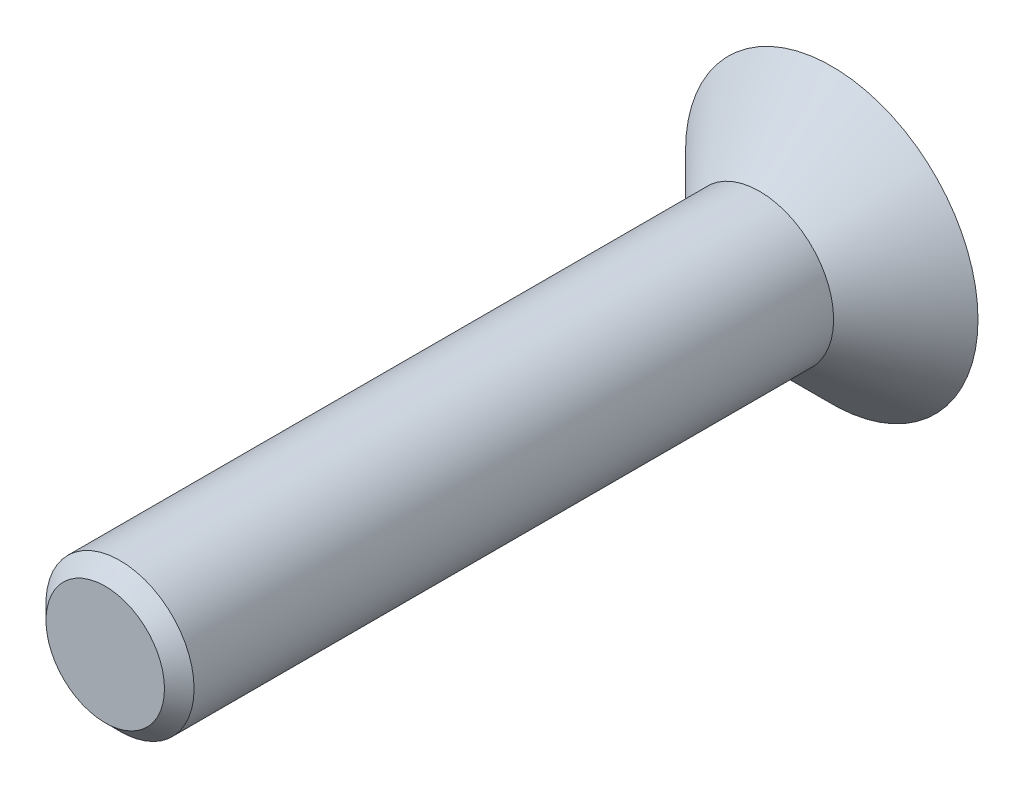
ISO-10303-21;
HEADER;
FILE_DESCRIPTION(('STEP AP214'),'2;1');
FILE_NAME('part.step','',(''),(''),'','','');
FILE_SCHEMA(('AUTOMOTIVE_DESIGN { 1 0 10303 214 1 1 1 1 }'));
ENDSEC;
DATA;
#1=APPLICATION_CONTEXT('core data for automotive mechanical design processes');
#2=APPLICATION_PROTOCOL_DEFINITION('international standard','automotive_design',2000,#1);
#3=PRODUCT_CONTEXT('',#1,'mechanical');
#4=PRODUCT('Part','Part','',(#3));
#5=PRODUCT_RELATED_PRODUCT_CATEGORY('part','',(#4));
#6=PRODUCT_DEFINITION_FORMATION('','',#4);
#7=PRODUCT_DEFINITION_CONTEXT('part definition',#1,'design');
#8=PRODUCT_DEFINITION('design','',#6,#7);
#9=PRODUCT_DEFINITION_SHAPE('','',#8);
#10=(LENGTH_UNIT() NAMED_UNIT(*) SI_UNIT(.MILLI.,.METRE.));
#11=(NAMED_UNIT(*) PLANE_ANGLE_UNIT() SI_UNIT($,.RADIAN.));
#12=(NAMED_UNIT(*) SI_UNIT($,.STERADIAN.) SOLID_ANGLE_UNIT());
#13=UNCERTAINTY_MEASURE_WITH_UNIT(LENGTH_MEASURE(1.E-05),#10,'distance_accuracy_value','');
#14=(GEOMETRIC_REPRESENTATION_CONTEXT(3) GLOBAL_UNCERTAINTY_ASSIGNED_CONTEXT((#13)) GLOBAL_UNIT_ASSIGNED_CONTEXT((#10,
#11,#12)) REPRESENTATION_CONTEXT('',''));
#15=CARTESIAN_POINT('',(0.,0.,0.));
#16=DIRECTION('',(0.,0.,1.));
#17=DIRECTION('',(1.,0.,0.));
#18=AXIS2_PLACEMENT_3D('',#15,#16,#17);
#19=CARTESIAN_POINT('',(0.,0.,-3.89999999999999));
#20=DIRECTION('',(0.,0.,1.));
#21=DIRECTION('',(1.,0.,0.));
#22=AXIS2_PLACEMENT_3D('',#19,#20,#21);
#23=PLANE('',#22);
#24=CARTESIAN_POINT('',(0.,0.,-3.89999999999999));
#25=DIRECTION('',(0.,0.,-1.));
#26=DIRECTION('',(-1.,0.,0.));
#27=AXIS2_PLACEMENT_3D('',#24,#25,#26);
#28=CIRCLE('',#27,7.9);
#29=CARTESIAN_POINT('',(-7.9,0.,-3.89999999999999));
#30=VERTEX_POINT('',#29);
#31=EDGE_CURVE('E138',#30,#30,#28,.T.);
#32=ORIENTED_EDGE('',*,*,#31,.T.);
#33=EDGE_LOOP('',(#32));
#34=FACE_BOUND('',#33,.T.);
#35=DIRECTION('',(-0.86602540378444,0.499999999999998,0.));
#36=VECTOR('',#35,1.);
#37=CARTESIAN_POINT('',(0.,2.88675134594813,-3.89999999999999));
#38=LINE('',#37,#36);
#39=CARTESIAN_POINT('',(2.5,1.44337567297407,-3.89999999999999));
#40=VERTEX_POINT('',#39);
#41=CARTESIAN_POINT('',(0.,2.88675134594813,-3.89999999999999));
#42=VERTEX_POINT('',#41);
#43=EDGE_CURVE('E46',#40,#42,#38,.T.);
#44=ORIENTED_EDGE('',*,*,#43,.T.);
#45=DIRECTION('',(-0.866025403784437,-0.500000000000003,0.));
#46=VECTOR('',#45,1.);
#47=CARTESIAN_POINT('',(-2.5,1.44337567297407,-3.89999999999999));
#48=LINE('',#47,#46);
#49=CARTESIAN_POINT('',(-2.5,1.44337567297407,-3.89999999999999));
#50=VERTEX_POINT('',#49);
#51=EDGE_CURVE('E117',#42,#50,#48,.T.);
#52=ORIENTED_EDGE('',*,*,#51,.T.);
#53=DIRECTION('',(0.,-1.,0.));
#54=VECTOR('',#53,1.);
#55=CARTESIAN_POINT('',(-2.5,-1.44337567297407,-3.89999999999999));
#56=LINE('',#55,#54);
#57=CARTESIAN_POINT('',(-2.5,-1.44337567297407,-3.89999999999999));
#58=VERTEX_POINT('',#57);
#59=EDGE_CURVE('E121',#50,#58,#56,.T.);
#60=ORIENTED_EDGE('',*,*,#59,.T.);
#61=DIRECTION('',(0.866025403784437,-0.500000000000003,0.));
#62=VECTOR('',#61,1.);
#63=CARTESIAN_POINT('',(-2.5,-1.44337567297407,-3.89999999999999));
#64=LINE('',#63,#62);
#65=CARTESIAN_POINT('',(0.,-2.88675134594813,-3.89999999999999));
#66=VERTEX_POINT('',#65);
#67=EDGE_CURVE('E124',#58,#66,#64,.T.);
#68=ORIENTED_EDGE('',*,*,#67,.T.);
#69=DIRECTION('',(0.86602540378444,0.499999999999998,0.));
#70=VECTOR('',#69,1.);
#71=CARTESIAN_POINT('',(0.,-2.88675134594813,-3.89999999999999));
#72=LINE('',#71,#70);
#73=CARTESIAN_POINT('',(2.5,-1.44337567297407,-3.89999999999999));
#74=VERTEX_POINT('',#73);
#75=EDGE_CURVE('E107',#66,#74,#72,.T.);
#76=ORIENTED_EDGE('',*,*,#75,.T.);
#77=DIRECTION('',(0.,1.,0.));
#78=VECTOR('',#77,1.);
#79=CARTESIAN_POINT('',(2.5,-1.44337567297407,-3.89999999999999));
#80=LINE('',#79,#78);
#81=EDGE_CURVE('E127',#74,#40,#80,.T.);
#82=ORIENTED_EDGE('',*,*,#81,.T.);
#83=EDGE_LOOP('',(#44,#52,#60,#68,#76,#82));
#84=FACE_BOUND('',#83,.T.);
#85=ADVANCED_FACE('F31',(#34,#84),#23,.F.);
#86=CARTESIAN_POINT('',(0.,0.,0.));
#87=DIRECTION('',(0.,0.,-1.));
#88=DIRECTION('',(-1.,0.,0.));
#89=AXIS2_PLACEMENT_3D('',#86,#87,#88);
#90=CONICAL_SURFACE('',#89,4.,0.78539816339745);
#91=ORIENTED_EDGE('',*,*,#31,.F.);
#92=EDGE_LOOP('',(#91));
#93=FACE_BOUND('',#92,.T.);
#94=CARTESIAN_POINT('',(0.,0.,0.));
#95=DIRECTION('',(0.,0.,1.));
#96=DIRECTION('',(1.,0.,0.));
#97=AXIS2_PLACEMENT_3D('',#94,#95,#96);
#98=CIRCLE('',#97,4.);
#99=CARTESIAN_POINT('',(4.,0.,0.));
#100=VERTEX_POINT('',#99);
#101=EDGE_CURVE('E118',#100,#100,#98,.T.);
#102=ORIENTED_EDGE('',*,*,#101,.F.);
#103=EDGE_LOOP('',(#102));
#104=FACE_BOUND('',#103,.T.);
#105=ADVANCED_FACE('F155',(#93,#104),#90,.T.);
#106=CARTESIAN_POINT('',(0.,2.88675134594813,-0.0999999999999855));
#107=DIRECTION('',(-0.499999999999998,-0.86602540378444,0.));
#108=DIRECTION('',(0.86602540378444,-0.499999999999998,0.));
#109=AXIS2_PLACEMENT_3D('',#106,#107,#108);
#110=PLANE('',#109);
#111=ORIENTED_EDGE('',*,*,#43,.F.);
#112=DIRECTION('',(0.,0.,-1.));
#113=VECTOR('',#112,1.);
#114=CARTESIAN_POINT('',(2.5,1.44337567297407,-0.0999999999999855));
#115=LINE('',#114,#113);
#116=CARTESIAN_POINT('',(2.5,1.44337567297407,-0.0999999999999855));
#117=VERTEX_POINT('',#116);
#118=EDGE_CURVE('E112',#117,#40,#115,.T.);
#119=ORIENTED_EDGE('',*,*,#118,.F.);
#120=DIRECTION('',(-0.86602540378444,0.499999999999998,0.));
#121=VECTOR('',#120,1.);
#122=CARTESIAN_POINT('',(0.,2.88675134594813,-0.0999999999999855));
#123=LINE('',#122,#121);
#124=CARTESIAN_POINT('',(0.,2.88675134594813,-0.0999999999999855));
#125=VERTEX_POINT('',#124);
#126=EDGE_CURVE('E130',#117,#125,#123,.T.);
#127=ORIENTED_EDGE('',*,*,#126,.T.);
#128=DIRECTION('',(0.,0.,-1.));
#129=VECTOR('',#128,1.);
#130=CARTESIAN_POINT('',(0.,2.88675134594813,-0.0999999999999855));
#131=LINE('',#130,#129);
#132=EDGE_CURVE('E136',#125,#42,#131,.T.);
#133=ORIENTED_EDGE('',*,*,#132,.T.);
#134=EDGE_LOOP('',(#111,#119,#127,#133));
#135=FACE_BOUND('',#134,.T.);
#136=ADVANCED_FACE('F160',(#135),#110,.T.);
#137=CARTESIAN_POINT('',(-2.5,1.44337567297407,-0.0999999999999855));
#138=DIRECTION('',(0.500000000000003,-0.866025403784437,0.));
#139=DIRECTION('',(0.866025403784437,0.500000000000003,0.));
#140=AXIS2_PLACEMENT_3D('',#137,#138,#139);
#141=PLANE('',#140);
#142=ORIENTED_EDGE('',*,*,#51,.F.);
#143=ORIENTED_EDGE('',*,*,#132,.F.);
#144=DIRECTION('',(-0.866025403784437,-0.500000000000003,0.));
#145=VECTOR('',#144,1.);
#146=CARTESIAN_POINT('',(-2.5,1.44337567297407,-0.0999999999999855));
#147=LINE('',#146,#145);
#148=CARTESIAN_POINT('',(-2.5,1.44337567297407,-0.0999999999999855));
#149=VERTEX_POINT('',#148);
#150=EDGE_CURVE('E85',#125,#149,#147,.T.);
#151=ORIENTED_EDGE('',*,*,#150,.T.);
#152=DIRECTION('',(0.,0.,-1.));
#153=VECTOR('',#152,1.);
#154=CARTESIAN_POINT('',(-2.5,1.44337567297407,-0.0999999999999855));
#155=LINE('',#154,#153);
#156=EDGE_CURVE('E134',#149,#50,#155,.T.);
#157=ORIENTED_EDGE('',*,*,#156,.T.);
#158=EDGE_LOOP('',(#142,#143,#151,#157));
#159=FACE_BOUND('',#158,.T.);
#160=ADVANCED_FACE('F167',(#159),#141,.T.);
#161=CARTESIAN_POINT('',(-2.5,-1.44337567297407,-0.0999999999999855));
#162=DIRECTION('',(1.,0.,0.));
#163=DIRECTION('',(0.,0.,-1.));
#164=AXIS2_PLACEMENT_3D('',#161,#162,#163);
#165=PLANE('',#164);
#166=ORIENTED_EDGE('',*,*,#59,.F.);
#167=ORIENTED_EDGE('',*,*,#156,.F.);
#168=DIRECTION('',(0.,-1.,0.));
#169=VECTOR('',#168,1.);
#170=CARTESIAN_POINT('',(-2.5,-1.44337567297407,-0.0999999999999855));
#171=LINE('',#170,#169);
#172=CARTESIAN_POINT('',(-2.5,-1.44337567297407,-0.0999999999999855));
#173=VERTEX_POINT('',#172);
#174=EDGE_CURVE('E103',#149,#173,#171,.T.);
#175=ORIENTED_EDGE('',*,*,#174,.T.);
#176=DIRECTION('',(0.,0.,-1.));
#177=VECTOR('',#176,1.);
#178=CARTESIAN_POINT('',(-2.5,-1.44337567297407,-0.0999999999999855));
#179=LINE('',#178,#177);
#180=EDGE_CURVE('E100',#173,#58,#179,.T.);
#181=ORIENTED_EDGE('',*,*,#180,.T.);
#182=EDGE_LOOP('',(#166,#167,#175,#181));
#183=FACE_BOUND('',#182,.T.);
#184=ADVANCED_FACE('F170',(#183),#165,.T.);
#185=CARTESIAN_POINT('',(-2.5,-1.44337567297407,-0.0999999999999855));
#186=DIRECTION('',(0.500000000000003,0.866025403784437,0.));
#187=DIRECTION('',(-0.866025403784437,0.500000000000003,0.));
#188=AXIS2_PLACEMENT_3D('',#185,#186,#187);
#189=PLANE('',#188);
#190=ORIENTED_EDGE('',*,*,#67,.F.);
#191=ORIENTED_EDGE('',*,*,#180,.F.);
#192=DIRECTION('',(0.866025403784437,-0.500000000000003,0.));
#193=VECTOR('',#192,1.);
#194=CARTESIAN_POINT('',(-2.5,-1.44337567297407,-0.0999999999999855));
#195=LINE('',#194,#193);
#196=CARTESIAN_POINT('',(0.,-2.88675134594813,-0.0999999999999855));
#197=VERTEX_POINT('',#196);
#198=EDGE_CURVE('E95',#173,#197,#195,.T.);
#199=ORIENTED_EDGE('',*,*,#198,.T.);
#200=DIRECTION('',(0.,0.,-1.));
#201=VECTOR('',#200,1.);
#202=CARTESIAN_POINT('',(0.,-2.88675134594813,-0.0999999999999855));
#203=LINE('',#202,#201);
#204=EDGE_CURVE('E99',#197,#66,#203,.T.);
#205=ORIENTED_EDGE('',*,*,#204,.T.);
#206=EDGE_LOOP('',(#190,#191,#199,#205));
#207=FACE_BOUND('',#206,.T.);
#208=ADVANCED_FACE('F98',(#207),#189,.T.);
#209=CARTESIAN_POINT('',(0.,-2.88675134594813,-0.0999999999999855));
#210=DIRECTION('',(-0.499999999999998,0.86602540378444,0.));
#211=DIRECTION('',(-0.86602540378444,-0.499999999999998,0.));
#212=AXIS2_PLACEMENT_3D('',#209,#210,#211);
#213=PLANE('',#212);
#214=ORIENTED_EDGE('',*,*,#75,.F.);
#215=ORIENTED_EDGE('',*,*,#204,.F.);
#216=DIRECTION('',(0.86602540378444,0.499999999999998,0.));
#217=VECTOR('',#216,1.);
#218=CARTESIAN_POINT('',(0.,-2.88675134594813,-0.0999999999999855));
#219=LINE('',#218,#217);
#220=CARTESIAN_POINT('',(2.5,-1.44337567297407,-0.0999999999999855));
#221=VERTEX_POINT('',#220);
#222=EDGE_CURVE('E102',#197,#221,#219,.T.);
#223=ORIENTED_EDGE('',*,*,#222,.T.);
#224=DIRECTION('',(0.,0.,-1.));
#225=VECTOR('',#224,1.);
#226=CARTESIAN_POINT('',(2.5,-1.44337567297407,-0.0999999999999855));
#227=LINE('',#226,#225);
#228=EDGE_CURVE('E76',#221,#74,#227,.T.);
#229=ORIENTED_EDGE('',*,*,#228,.T.);
#230=EDGE_LOOP('',(#214,#215,#223,#229));
#231=FACE_BOUND('',#230,.T.);
#232=ADVANCED_FACE('F105',(#231),#213,.T.);
#233=CARTESIAN_POINT('',(2.5,-1.44337567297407,-0.0999999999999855));
#234=DIRECTION('',(-1.,0.,0.));
#235=DIRECTION('',(0.,0.,1.));
#236=AXIS2_PLACEMENT_3D('',#233,#234,#235);
#237=PLANE('',#236);
#238=ORIENTED_EDGE('',*,*,#81,.F.);
#239=ORIENTED_EDGE('',*,*,#228,.F.);
#240=DIRECTION('',(0.,1.,0.));
#241=VECTOR('',#240,1.);
#242=CARTESIAN_POINT('',(2.5,-1.44337567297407,-0.0999999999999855));
#243=LINE('',#242,#241);
#244=EDGE_CURVE('E54',#221,#117,#243,.T.);
#245=ORIENTED_EDGE('',*,*,#244,.T.);
#246=ORIENTED_EDGE('',*,*,#118,.T.);
#247=EDGE_LOOP('',(#238,#239,#245,#246));
#248=FACE_BOUND('',#247,.T.);
#249=ADVANCED_FACE('F179',(#248),#237,.T.);
#250=CARTESIAN_POINT('',(2.5,1.44337567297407,-0.0999999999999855));
#251=DIRECTION('',(0.,0.,1.));
#252=DIRECTION('',(1.,0.,0.));
#253=AXIS2_PLACEMENT_3D('',#250,#251,#252);
#254=PLANE('',#253);
#255=ORIENTED_EDGE('',*,*,#126,.F.);
#256=ORIENTED_EDGE('',*,*,#244,.F.);
#257=ORIENTED_EDGE('',*,*,#222,.F.);
#258=ORIENTED_EDGE('',*,*,#198,.F.);
#259=ORIENTED_EDGE('',*,*,#174,.F.);
#260=ORIENTED_EDGE('',*,*,#150,.F.);
#261=EDGE_LOOP('',(#255,#256,#257,#258,#259,#260));
#262=FACE_BOUND('',#261,.T.);
#263=ADVANCED_FACE('F110',(#262),#254,.F.);
#264=CARTESIAN_POINT('',(0.,0.,35.35));
#265=DIRECTION('',(0.,0.,1.));
#266=DIRECTION('',(1.,0.,0.));
#267=AXIS2_PLACEMENT_3D('',#264,#265,#266);
#268=PLANE('',#267);
#269=CARTESIAN_POINT('',(0.,0.,35.35));
#270=DIRECTION('',(0.,0.,1.));
#271=DIRECTION('',(1.,0.,0.));
#272=AXIS2_PLACEMENT_3D('',#269,#270,#271);
#273=CIRCLE('',#272,3.2);
#274=CARTESIAN_POINT('',(3.2,0.,35.35));
#275=VERTEX_POINT('',#274);
#276=EDGE_CURVE('E39',#275,#275,#273,.T.);
#277=ORIENTED_EDGE('',*,*,#276,.T.);
#278=EDGE_LOOP('',(#277));
#279=FACE_BOUND('',#278,.T.);
#280=ADVANCED_FACE('F143',(#279),#268,.T.);
#281=CARTESIAN_POINT('',(0.,0.,0.));
#282=DIRECTION('',(0.,0.,1.));
#283=DIRECTION('',(1.,0.,0.));
#284=AXIS2_PLACEMENT_3D('',#281,#282,#283);
#285=CYLINDRICAL_SURFACE('',#284,4.);
#286=CARTESIAN_POINT('',(0.,0.,34.55));
#287=DIRECTION('',(0.,0.,1.));
#288=DIRECTION('',(1.,0.,0.));
#289=AXIS2_PLACEMENT_3D('',#286,#287,#288);
#290=CIRCLE('',#289,4.);
#291=CARTESIAN_POINT('',(4.,0.,34.55));
#292=VERTEX_POINT('',#291);
#293=EDGE_CURVE('E11',#292,#292,#290,.F.);
#294=ORIENTED_EDGE('',*,*,#293,.T.);
#295=EDGE_LOOP('',(#294));
#296=FACE_BOUND('',#295,.T.);
#297=ORIENTED_EDGE('',*,*,#101,.T.);
#298=EDGE_LOOP('',(#297));
#299=FACE_BOUND('',#298,.T.);
#300=ADVANCED_FACE('F146',(#296,#299),#285,.T.);
#301=CARTESIAN_POINT('',(0.,0.,35.35));
#302=DIRECTION('',(0.,0.,-1.));
#303=DIRECTION('',(-1.,0.,0.));
#304=AXIS2_PLACEMENT_3D('',#301,#302,#303);
#305=CONICAL_SURFACE('',#304,3.2,0.785398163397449);
#306=ORIENTED_EDGE('',*,*,#293,.F.);
#307=EDGE_LOOP('',(#306));
#308=FACE_BOUND('',#307,.T.);
#309=ORIENTED_EDGE('',*,*,#276,.F.);
#310=EDGE_LOOP('',(#309));
#311=FACE_BOUND('',#310,.T.);
#312=ADVANCED_FACE('F33',(#308,#311),#305,.T.);
#313=CLOSED_SHELL('',(#85,#105,#136,#160,#184,#208,#232,#249,#263,#280,#300,#312));
#314=MANIFOLD_SOLID_BREP('B2',#313);
#315=ADVANCED_BREP_SHAPE_REPRESENTATION('',(#18,#314),#14);
#316=SHAPE_DEFINITION_REPRESENTATION(#9,#315);
ENDSEC;
END-ISO-10303-21;
